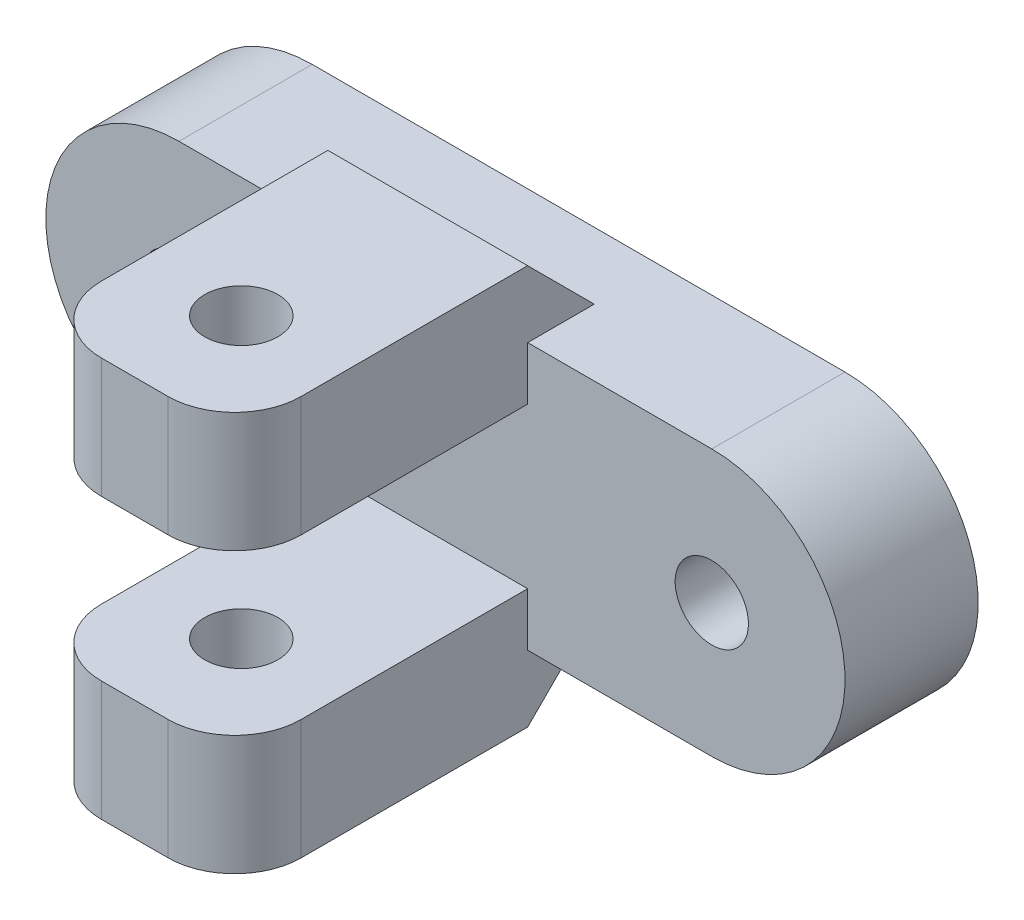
ISO-10303-21;
HEADER;
FILE_DESCRIPTION(('STEP AP214'),'2;1');
FILE_NAME('part.step','',(''),(''),'','','');
FILE_SCHEMA(('AUTOMOTIVE_DESIGN { 1 0 10303 214 1 1 1 1 }'));
ENDSEC;
DATA;
#1=APPLICATION_CONTEXT('core data for automotive mechanical design processes');
#2=APPLICATION_PROTOCOL_DEFINITION('international standard','automotive_design',2000,#1);
#3=PRODUCT_CONTEXT('',#1,'mechanical');
#4=PRODUCT('Part','Part','',(#3));
#5=PRODUCT_RELATED_PRODUCT_CATEGORY('part','',(#4));
#6=PRODUCT_DEFINITION_FORMATION('','',#4);
#7=PRODUCT_DEFINITION_CONTEXT('part definition',#1,'design');
#8=PRODUCT_DEFINITION('design','',#6,#7);
#9=PRODUCT_DEFINITION_SHAPE('','',#8);
#10=(LENGTH_UNIT() NAMED_UNIT(*) SI_UNIT(.MILLI.,.METRE.));
#11=(NAMED_UNIT(*) PLANE_ANGLE_UNIT() SI_UNIT($,.RADIAN.));
#12=(NAMED_UNIT(*) SI_UNIT($,.STERADIAN.) SOLID_ANGLE_UNIT());
#13=UNCERTAINTY_MEASURE_WITH_UNIT(LENGTH_MEASURE(1.E-05),#10,'distance_accuracy_value','');
#14=(GEOMETRIC_REPRESENTATION_CONTEXT(3) GLOBAL_UNCERTAINTY_ASSIGNED_CONTEXT((#13)) GLOBAL_UNIT_ASSIGNED_CONTEXT((#10,
#11,#12)) REPRESENTATION_CONTEXT('',''));
#15=CARTESIAN_POINT('',(0.,0.,0.));
#16=DIRECTION('',(0.,0.,1.));
#17=DIRECTION('',(1.,0.,0.));
#18=AXIS2_PLACEMENT_3D('',#15,#16,#17);
#19=CARTESIAN_POINT('',(-43.018930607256,15.,17.));
#20=DIRECTION('',(0.,-1.,0.));
#21=DIRECTION('',(1.,0.,0.));
#22=AXIS2_PLACEMENT_3D('',#19,#20,#21);
#23=CYLINDRICAL_SURFACE('',#22,5.);
#24=DIRECTION('',(0.,1.,0.));
#25=VECTOR('',#24,1.);
#26=CARTESIAN_POINT('',(-48.018930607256,15.,17.));
#27=LINE('',#26,#25);
#28=CARTESIAN_POINT('',(-48.018930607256,6.,17.));
#29=VERTEX_POINT('',#28);
#30=CARTESIAN_POINT('',(-48.018930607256,15.,17.));
#31=VERTEX_POINT('',#30);
#32=EDGE_CURVE('E330',#29,#31,#27,.T.);
#33=ORIENTED_EDGE('',*,*,#32,.F.);
#34=CARTESIAN_POINT('',(-43.018930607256,6.,17.));
#35=DIRECTION('',(0.,1.,0.));
#36=DIRECTION('',(0.,0.,1.));
#37=AXIS2_PLACEMENT_3D('',#34,#35,#36);
#38=CIRCLE('',#37,5.);
#39=CARTESIAN_POINT('',(-43.018930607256,6.,22.));
#40=VERTEX_POINT('',#39);
#41=EDGE_CURVE('E40',#40,#29,#38,.F.);
#42=ORIENTED_EDGE('',*,*,#41,.F.);
#43=DIRECTION('',(0.,1.,0.));
#44=VECTOR('',#43,1.);
#45=CARTESIAN_POINT('',(-43.018930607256,15.,22.));
#46=LINE('',#45,#44);
#47=CARTESIAN_POINT('',(-43.018930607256,15.,22.));
#48=VERTEX_POINT('',#47);
#49=EDGE_CURVE('E333',#48,#40,#46,.F.);
#50=ORIENTED_EDGE('',*,*,#49,.F.);
#51=CARTESIAN_POINT('',(-43.018930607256,15.,17.));
#52=DIRECTION('',(0.,-1.,0.));
#53=DIRECTION('',(0.,0.,-1.));
#54=AXIS2_PLACEMENT_3D('',#51,#52,#53);
#55=CIRCLE('',#54,5.);
#56=EDGE_CURVE('E11',#31,#48,#55,.F.);
#57=ORIENTED_EDGE('',*,*,#56,.F.);
#58=EDGE_LOOP('',(#33,#42,#50,#57));
#59=FACE_BOUND('',#58,.T.);
#60=ADVANCED_FACE('F33',(#59),#23,.T.);
#61=CARTESIAN_POINT('',(-38.018930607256,15.,17.));
#62=DIRECTION('',(0.,1.,0.));
#63=DIRECTION('',(-1.,0.,0.));
#64=AXIS2_PLACEMENT_3D('',#61,#62,#63);
#65=CYLINDRICAL_SURFACE('',#64,5.);
#66=DIRECTION('',(0.,-1.,0.));
#67=VECTOR('',#66,1.);
#68=CARTESIAN_POINT('',(-33.018930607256,15.,17.));
#69=LINE('',#68,#67);
#70=CARTESIAN_POINT('',(-33.018930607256,15.,17.));
#71=VERTEX_POINT('',#70);
#72=CARTESIAN_POINT('',(-33.018930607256,6.,17.));
#73=VERTEX_POINT('',#72);
#74=EDGE_CURVE('E319',#71,#73,#69,.T.);
#75=ORIENTED_EDGE('',*,*,#74,.F.);
#76=CARTESIAN_POINT('',(-38.018930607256,15.,17.));
#77=DIRECTION('',(0.,-1.,0.));
#78=DIRECTION('',(0.,0.,-1.));
#79=AXIS2_PLACEMENT_3D('',#76,#77,#78);
#80=CIRCLE('',#79,5.);
#81=CARTESIAN_POINT('',(-38.018930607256,15.,22.));
#82=VERTEX_POINT('',#81);
#83=EDGE_CURVE('E325',#82,#71,#80,.F.);
#84=ORIENTED_EDGE('',*,*,#83,.F.);
#85=DIRECTION('',(0.,-1.,0.));
#86=VECTOR('',#85,1.);
#87=CARTESIAN_POINT('',(-38.018930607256,15.,22.));
#88=LINE('',#87,#86);
#89=CARTESIAN_POINT('',(-38.018930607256,6.,22.));
#90=VERTEX_POINT('',#89);
#91=EDGE_CURVE('E322',#90,#82,#88,.F.);
#92=ORIENTED_EDGE('',*,*,#91,.F.);
#93=CARTESIAN_POINT('',(-38.018930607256,6.,17.));
#94=DIRECTION('',(0.,1.,0.));
#95=DIRECTION('',(0.,0.,1.));
#96=AXIS2_PLACEMENT_3D('',#93,#94,#95);
#97=CIRCLE('',#96,5.);
#98=EDGE_CURVE('E327',#73,#90,#97,.F.);
#99=ORIENTED_EDGE('',*,*,#98,.F.);
#100=EDGE_LOOP('',(#75,#84,#92,#99));
#101=FACE_BOUND('',#100,.T.);
#102=ADVANCED_FACE('F399',(#101),#65,.T.);
#103=CARTESIAN_POINT('',(-43.018930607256,15.,17.));
#104=DIRECTION('',(0.,-1.,0.));
#105=DIRECTION('',(1.,0.,0.));
#106=AXIS2_PLACEMENT_3D('',#103,#104,#105);
#107=CYLINDRICAL_SURFACE('',#106,5.);
#108=DIRECTION('',(0.,1.,0.));
#109=VECTOR('',#108,1.);
#110=CARTESIAN_POINT('',(-48.018930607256,15.,17.));
#111=LINE('',#110,#109);
#112=CARTESIAN_POINT('',(-48.018930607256,-15.,17.));
#113=VERTEX_POINT('',#112);
#114=CARTESIAN_POINT('',(-48.018930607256,-6.,17.));
#115=VERTEX_POINT('',#114);
#116=EDGE_CURVE('E176',#113,#115,#111,.T.);
#117=ORIENTED_EDGE('',*,*,#116,.F.);
#118=CARTESIAN_POINT('',(-43.018930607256,-15.,17.));
#119=DIRECTION('',(0.,1.,0.));
#120=DIRECTION('',(0.,0.,1.));
#121=AXIS2_PLACEMENT_3D('',#118,#119,#120);
#122=CIRCLE('',#121,5.);
#123=CARTESIAN_POINT('',(-43.018930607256,-15.,22.));
#124=VERTEX_POINT('',#123);
#125=EDGE_CURVE('E315',#124,#113,#122,.F.);
#126=ORIENTED_EDGE('',*,*,#125,.F.);
#127=DIRECTION('',(0.,1.,0.));
#128=VECTOR('',#127,1.);
#129=CARTESIAN_POINT('',(-43.018930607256,15.,22.));
#130=LINE('',#129,#128);
#131=CARTESIAN_POINT('',(-43.018930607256,-6.,22.));
#132=VERTEX_POINT('',#131);
#133=EDGE_CURVE('E312',#132,#124,#130,.F.);
#134=ORIENTED_EDGE('',*,*,#133,.F.);
#135=CARTESIAN_POINT('',(-43.018930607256,-6.,17.));
#136=DIRECTION('',(0.,-1.,0.));
#137=DIRECTION('',(0.,0.,-1.));
#138=AXIS2_PLACEMENT_3D('',#135,#136,#137);
#139=CIRCLE('',#138,5.);
#140=EDGE_CURVE('E317',#115,#132,#139,.F.);
#141=ORIENTED_EDGE('',*,*,#140,.F.);
#142=EDGE_LOOP('',(#117,#126,#134,#141));
#143=FACE_BOUND('',#142,.T.);
#144=ADVANCED_FACE('F374',(#143),#107,.T.);
#145=CARTESIAN_POINT('',(-38.018930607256,0.,17.));
#146=DIRECTION('',(0.,-1.,0.));
#147=DIRECTION('',(1.,0.,0.));
#148=AXIS2_PLACEMENT_3D('',#145,#146,#147);
#149=CYLINDRICAL_SURFACE('',#148,5.);
#150=DIRECTION('',(0.,1.,0.));
#151=VECTOR('',#150,1.);
#152=CARTESIAN_POINT('',(-38.018930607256,0.,22.));
#153=LINE('',#152,#151);
#154=CARTESIAN_POINT('',(-38.018930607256,-15.,22.));
#155=VERTEX_POINT('',#154);
#156=CARTESIAN_POINT('',(-38.018930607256,-6.,22.));
#157=VERTEX_POINT('',#156);
#158=EDGE_CURVE('E300',#155,#157,#153,.T.);
#159=ORIENTED_EDGE('',*,*,#158,.F.);
#160=CARTESIAN_POINT('',(-38.018930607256,-15.,17.));
#161=DIRECTION('',(0.,1.,0.));
#162=DIRECTION('',(0.,0.,1.));
#163=AXIS2_PLACEMENT_3D('',#160,#161,#162);
#164=CIRCLE('',#163,5.);
#165=CARTESIAN_POINT('',(-33.018930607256,-15.,17.));
#166=VERTEX_POINT('',#165);
#167=EDGE_CURVE('E306',#166,#155,#164,.F.);
#168=ORIENTED_EDGE('',*,*,#167,.F.);
#169=DIRECTION('',(0.,1.,0.));
#170=VECTOR('',#169,1.);
#171=CARTESIAN_POINT('',(-33.018930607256,0.,17.));
#172=LINE('',#171,#170);
#173=CARTESIAN_POINT('',(-33.018930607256,-6.,17.));
#174=VERTEX_POINT('',#173);
#175=EDGE_CURVE('E303',#174,#166,#172,.F.);
#176=ORIENTED_EDGE('',*,*,#175,.F.);
#177=CARTESIAN_POINT('',(-38.018930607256,-6.,17.));
#178=DIRECTION('',(0.,-1.,0.));
#179=DIRECTION('',(0.,0.,-1.));
#180=AXIS2_PLACEMENT_3D('',#177,#178,#179);
#181=CIRCLE('',#180,5.);
#182=EDGE_CURVE('E309',#157,#174,#181,.F.);
#183=ORIENTED_EDGE('',*,*,#182,.F.);
#184=EDGE_LOOP('',(#159,#168,#176,#183));
#185=FACE_BOUND('',#184,.T.);
#186=ADVANCED_FACE('F372',(#185),#149,.T.);
#187=CARTESIAN_POINT('',(-48.018930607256,15.,30.));
#188=DIRECTION('',(1.,0.,0.));
#189=DIRECTION('',(0.,1.,0.));
#190=AXIS2_PLACEMENT_3D('',#187,#188,#189);
#191=PLANE('',#190);
#192=DIRECTION('',(0.,0.,1.));
#193=VECTOR('',#192,1.);
#194=CARTESIAN_POINT('',(-48.018930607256,6.,30.));
#195=LINE('',#194,#193);
#196=CARTESIAN_POINT('',(-48.018930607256,6.,0.));
#197=VERTEX_POINT('',#196);
#198=EDGE_CURVE('E206',#197,#29,#195,.T.);
#199=ORIENTED_EDGE('',*,*,#198,.T.);
#200=ORIENTED_EDGE('',*,*,#32,.T.);
#201=DIRECTION('',(0.,0.,-1.));
#202=VECTOR('',#201,1.);
#203=CARTESIAN_POINT('',(-48.018930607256,15.,30.));
#204=LINE('',#203,#202);
#205=CARTESIAN_POINT('',(-48.018930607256,15.,0.));
#206=VERTEX_POINT('',#205);
#207=EDGE_CURVE('E216',#31,#206,#204,.T.);
#208=ORIENTED_EDGE('',*,*,#207,.T.);
#209=DIRECTION('',(0.,-0.707106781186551,-0.707106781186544));
#210=VECTOR('',#209,1.);
#211=CARTESIAN_POINT('',(-48.018930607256,30.,14.9999999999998));
#212=LINE('',#211,#210);
#213=CARTESIAN_POINT('',(-48.018930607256,10.,-4.99999999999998));
#214=VERTEX_POINT('',#213);
#215=EDGE_CURVE('E295',#206,#214,#212,.T.);
#216=ORIENTED_EDGE('',*,*,#215,.T.);
#217=DIRECTION('',(0.,0.,-1.));
#218=VECTOR('',#217,1.);
#219=CARTESIAN_POINT('',(-48.018930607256,10.,-10.));
#220=LINE('',#219,#218);
#221=CARTESIAN_POINT('',(-48.018930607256,10.,0.));
#222=VERTEX_POINT('',#221);
#223=EDGE_CURVE('E292',#222,#214,#220,.T.);
#224=ORIENTED_EDGE('',*,*,#223,.F.);
#225=DIRECTION('',(0.,-1.,0.));
#226=VECTOR('',#225,1.);
#227=CARTESIAN_POINT('',(-48.018930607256,15.,0.));
#228=LINE('',#227,#226);
#229=EDGE_CURVE('E197',#222,#197,#228,.T.);
#230=ORIENTED_EDGE('',*,*,#229,.T.);
#231=EDGE_LOOP('',(#199,#200,#208,#216,#224,#230));
#232=FACE_BOUND('',#231,.T.);
#233=ADVANCED_FACE('F342',(#232),#191,.F.);
#234=CARTESIAN_POINT('',(-33.018930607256,15.,30.));
#235=DIRECTION('',(-1.,0.,0.));
#236=DIRECTION('',(0.,-1.,0.));
#237=AXIS2_PLACEMENT_3D('',#234,#235,#236);
#238=PLANE('',#237);
#239=DIRECTION('',(0.,0.,-1.));
#240=VECTOR('',#239,1.);
#241=CARTESIAN_POINT('',(-33.018930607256,15.,30.));
#242=LINE('',#241,#240);
#243=CARTESIAN_POINT('',(-33.018930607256,15.,0.));
#244=VERTEX_POINT('',#243);
#245=EDGE_CURVE('E218',#71,#244,#242,.T.);
#246=ORIENTED_EDGE('',*,*,#245,.F.);
#247=ORIENTED_EDGE('',*,*,#74,.T.);
#248=DIRECTION('',(0.,0.,-1.));
#249=VECTOR('',#248,1.);
#250=CARTESIAN_POINT('',(-33.018930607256,6.,30.));
#251=LINE('',#250,#249);
#252=CARTESIAN_POINT('',(-33.018930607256,6.,0.));
#253=VERTEX_POINT('',#252);
#254=EDGE_CURVE('E178',#73,#253,#251,.T.);
#255=ORIENTED_EDGE('',*,*,#254,.T.);
#256=DIRECTION('',(0.,1.,0.));
#257=VECTOR('',#256,1.);
#258=CARTESIAN_POINT('',(-33.018930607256,15.,0.));
#259=LINE('',#258,#257);
#260=CARTESIAN_POINT('',(-33.018930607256,10.,0.));
#261=VERTEX_POINT('',#260);
#262=EDGE_CURVE('E202',#253,#261,#259,.T.);
#263=ORIENTED_EDGE('',*,*,#262,.T.);
#264=DIRECTION('',(0.,0.,1.));
#265=VECTOR('',#264,1.);
#266=CARTESIAN_POINT('',(-33.018930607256,10.,-10.));
#267=LINE('',#266,#265);
#268=CARTESIAN_POINT('',(-33.018930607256,10.,-4.99999999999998));
#269=VERTEX_POINT('',#268);
#270=EDGE_CURVE('E287',#269,#261,#267,.T.);
#271=ORIENTED_EDGE('',*,*,#270,.F.);
#272=DIRECTION('',(0.,0.707106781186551,0.707106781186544));
#273=VECTOR('',#272,1.);
#274=CARTESIAN_POINT('',(-33.018930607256,30.,14.9999999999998));
#275=LINE('',#274,#273);
#276=EDGE_CURVE('E297',#269,#244,#275,.T.);
#277=ORIENTED_EDGE('',*,*,#276,.T.);
#278=EDGE_LOOP('',(#246,#247,#255,#263,#271,#277));
#279=FACE_BOUND('',#278,.T.);
#280=ADVANCED_FACE('F395',(#279),#238,.F.);
#281=DIRECTION('',(0.,0.,-1.));
#282=VECTOR('',#281,1.);
#283=CARTESIAN_POINT('',(-48.018930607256,-15.,30.));
#284=LINE('',#283,#282);
#285=CARTESIAN_POINT('',(-48.018930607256,-15.,0.));
#286=VERTEX_POINT('',#285);
#287=EDGE_CURVE('E222',#113,#286,#284,.T.);
#288=ORIENTED_EDGE('',*,*,#287,.F.);
#289=ORIENTED_EDGE('',*,*,#116,.T.);
#290=DIRECTION('',(0.,0.,-1.));
#291=VECTOR('',#290,1.);
#292=CARTESIAN_POINT('',(-48.018930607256,-6.,30.));
#293=LINE('',#292,#291);
#294=CARTESIAN_POINT('',(-48.018930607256,-6.,0.));
#295=VERTEX_POINT('',#294);
#296=EDGE_CURVE('E168',#115,#295,#293,.T.);
#297=ORIENTED_EDGE('',*,*,#296,.T.);
#298=CARTESIAN_POINT('',(-48.018930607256,-10.,0.));
#299=VERTEX_POINT('',#298);
#300=EDGE_CURVE('E173',#295,#299,#228,.T.);
#301=ORIENTED_EDGE('',*,*,#300,.T.);
#302=DIRECTION('',(0.,0.,1.));
#303=VECTOR('',#302,1.);
#304=CARTESIAN_POINT('',(-48.018930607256,-10.,-10.));
#305=LINE('',#304,#303);
#306=CARTESIAN_POINT('',(-48.018930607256,-10.,-4.99999999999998));
#307=VERTEX_POINT('',#306);
#308=EDGE_CURVE('E274',#307,#299,#305,.T.);
#309=ORIENTED_EDGE('',*,*,#308,.F.);
#310=DIRECTION('',(0.,-0.707106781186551,0.707106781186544));
#311=VECTOR('',#310,1.);
#312=CARTESIAN_POINT('',(-48.018930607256,-14.9999999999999,-1.59594559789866E-13));
#313=LINE('',#312,#311);
#314=EDGE_CURVE('E284',#307,#286,#313,.T.);
#315=ORIENTED_EDGE('',*,*,#314,.T.);
#316=EDGE_LOOP('',(#288,#289,#297,#301,#309,#315));
#317=FACE_BOUND('',#316,.T.);
#318=ADVANCED_FACE('F171',(#317),#191,.F.);
#319=CARTESIAN_POINT('',(-48.018930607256,-15.,30.));
#320=DIRECTION('',(0.,1.,0.));
#321=DIRECTION('',(0.,0.,1.));
#322=AXIS2_PLACEMENT_3D('',#319,#320,#321);
#323=PLANE('',#322);
#324=CARTESIAN_POINT('',(-40.518930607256,-15.,14.));
#325=DIRECTION('',(0.,-1.,0.));
#326=DIRECTION('',(0.,0.,-1.));
#327=AXIS2_PLACEMENT_3D('',#324,#325,#326);
#328=CIRCLE('',#327,2.75);
#329=CARTESIAN_POINT('',(-40.518930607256,-15.,11.25));
#330=VERTEX_POINT('',#329);
#331=EDGE_CURVE('E351',#330,#330,#328,.T.);
#332=ORIENTED_EDGE('',*,*,#331,.F.);
#333=EDGE_LOOP('',(#332));
#334=FACE_BOUND('',#333,.T.);
#335=DIRECTION('',(1.,0.,0.));
#336=VECTOR('',#335,1.);
#337=CARTESIAN_POINT('',(-48.018930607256,-15.,22.));
#338=LINE('',#337,#336);
#339=EDGE_CURVE('E360',#124,#155,#338,.T.);
#340=ORIENTED_EDGE('',*,*,#339,.F.);
#341=ORIENTED_EDGE('',*,*,#125,.T.);
#342=ORIENTED_EDGE('',*,*,#287,.T.);
#343=DIRECTION('',(1.,0.,0.));
#344=VECTOR('',#343,1.);
#345=CARTESIAN_POINT('',(-48.018930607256,-15.,0.));
#346=LINE('',#345,#344);
#347=CARTESIAN_POINT('',(-33.018930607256,-15.,0.));
#348=VERTEX_POINT('',#347);
#349=EDGE_CURVE('E208',#286,#348,#346,.T.);
#350=ORIENTED_EDGE('',*,*,#349,.T.);
#351=DIRECTION('',(0.,0.,-1.));
#352=VECTOR('',#351,1.);
#353=CARTESIAN_POINT('',(-33.018930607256,-15.,30.));
#354=LINE('',#353,#352);
#355=EDGE_CURVE('E220',#166,#348,#354,.T.);
#356=ORIENTED_EDGE('',*,*,#355,.F.);
#357=ORIENTED_EDGE('',*,*,#167,.T.);
#358=EDGE_LOOP('',(#340,#341,#342,#350,#356,#357));
#359=FACE_BOUND('',#358,.T.);
#360=ADVANCED_FACE('F369',(#334,#359),#323,.F.);
#361=DIRECTION('',(0.,0.,1.));
#362=VECTOR('',#361,1.);
#363=CARTESIAN_POINT('',(-33.018930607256,-6.,30.));
#364=LINE('',#363,#362);
#365=CARTESIAN_POINT('',(-33.018930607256,-6.,0.));
#366=VERTEX_POINT('',#365);
#367=EDGE_CURVE('E179',#366,#174,#364,.T.);
#368=ORIENTED_EDGE('',*,*,#367,.T.);
#369=ORIENTED_EDGE('',*,*,#175,.T.);
#370=ORIENTED_EDGE('',*,*,#355,.T.);
#371=DIRECTION('',(0.,0.707106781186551,-0.707106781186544));
#372=VECTOR('',#371,1.);
#373=CARTESIAN_POINT('',(-33.018930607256,-14.9999999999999,-1.59594559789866E-13));
#374=LINE('',#373,#372);
#375=CARTESIAN_POINT('',(-33.018930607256,-10.,-4.99999999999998));
#376=VERTEX_POINT('',#375);
#377=EDGE_CURVE('E282',#348,#376,#374,.T.);
#378=ORIENTED_EDGE('',*,*,#377,.T.);
#379=DIRECTION('',(0.,0.,-1.));
#380=VECTOR('',#379,1.);
#381=CARTESIAN_POINT('',(-33.018930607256,-10.,-10.));
#382=LINE('',#381,#380);
#383=CARTESIAN_POINT('',(-33.018930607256,-10.,0.));
#384=VERTEX_POINT('',#383);
#385=EDGE_CURVE('E279',#384,#376,#382,.T.);
#386=ORIENTED_EDGE('',*,*,#385,.F.);
#387=EDGE_CURVE('E198',#384,#366,#259,.T.);
#388=ORIENTED_EDGE('',*,*,#387,.T.);
#389=EDGE_LOOP('',(#368,#369,#370,#378,#386,#388));
#390=FACE_BOUND('',#389,.T.);
#391=ADVANCED_FACE('F382',(#390),#238,.F.);
#392=CARTESIAN_POINT('',(-48.018930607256,15.,30.));
#393=DIRECTION('',(0.,-1.,0.));
#394=DIRECTION('',(0.,0.,-1.));
#395=AXIS2_PLACEMENT_3D('',#392,#393,#394);
#396=PLANE('',#395);
#397=CARTESIAN_POINT('',(-40.518930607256,15.,14.));
#398=DIRECTION('',(0.,-1.,0.));
#399=DIRECTION('',(0.,0.,-1.));
#400=AXIS2_PLACEMENT_3D('',#397,#398,#399);
#401=CIRCLE('',#400,2.75);
#402=CARTESIAN_POINT('',(-40.518930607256,15.,11.25));
#403=VERTEX_POINT('',#402);
#404=EDGE_CURVE('E271',#403,#403,#401,.T.);
#405=ORIENTED_EDGE('',*,*,#404,.T.);
#406=EDGE_LOOP('',(#405));
#407=FACE_BOUND('',#406,.T.);
#408=ORIENTED_EDGE('',*,*,#207,.F.);
#409=ORIENTED_EDGE('',*,*,#56,.T.);
#410=DIRECTION('',(-1.,0.,0.));
#411=VECTOR('',#410,1.);
#412=CARTESIAN_POINT('',(-48.018930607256,15.,22.));
#413=LINE('',#412,#411);
#414=EDGE_CURVE('E354',#82,#48,#413,.T.);
#415=ORIENTED_EDGE('',*,*,#414,.F.);
#416=ORIENTED_EDGE('',*,*,#83,.T.);
#417=ORIENTED_EDGE('',*,*,#245,.T.);
#418=DIRECTION('',(-1.,0.,0.));
#419=VECTOR('',#418,1.);
#420=CARTESIAN_POINT('',(-48.018930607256,15.,0.));
#421=LINE('',#420,#419);
#422=EDGE_CURVE('E210',#244,#206,#421,.T.);
#423=ORIENTED_EDGE('',*,*,#422,.T.);
#424=EDGE_LOOP('',(#408,#409,#415,#416,#417,#423));
#425=FACE_BOUND('',#424,.T.);
#426=ADVANCED_FACE('F402',(#407,#425),#396,.F.);
#427=CARTESIAN_POINT('',(-49.2844659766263,6.,0.));
#428=DIRECTION('',(0.,1.,0.));
#429=DIRECTION('',(0.,0.,1.));
#430=AXIS2_PLACEMENT_3D('',#427,#428,#429);
#431=PLANE('',#430);
#432=CARTESIAN_POINT('',(-40.518930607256,6.,14.));
#433=DIRECTION('',(0.,1.,0.));
#434=DIRECTION('',(0.,0.,1.));
#435=AXIS2_PLACEMENT_3D('',#432,#433,#434);
#436=CIRCLE('',#435,2.75);
#437=CARTESIAN_POINT('',(-40.518930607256,6.,16.75));
#438=VERTEX_POINT('',#437);
#439=EDGE_CURVE('E189',#438,#438,#436,.T.);
#440=ORIENTED_EDGE('',*,*,#439,.T.);
#441=EDGE_LOOP('',(#440));
#442=FACE_BOUND('',#441,.T.);
#443=DIRECTION('',(1.,0.,0.));
#444=VECTOR('',#443,1.);
#445=CARTESIAN_POINT('',(-49.2844659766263,6.,22.));
#446=LINE('',#445,#444);
#447=EDGE_CURVE('E340',#40,#90,#446,.T.);
#448=ORIENTED_EDGE('',*,*,#447,.F.);
#449=ORIENTED_EDGE('',*,*,#41,.T.);
#450=ORIENTED_EDGE('',*,*,#198,.F.);
#451=DIRECTION('',(-1.,0.,0.));
#452=VECTOR('',#451,1.);
#453=CARTESIAN_POINT('',(-49.2844659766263,6.,0.));
#454=LINE('',#453,#452);
#455=EDGE_CURVE('E188',#253,#197,#454,.T.);
#456=ORIENTED_EDGE('',*,*,#455,.F.);
#457=ORIENTED_EDGE('',*,*,#254,.F.);
#458=ORIENTED_EDGE('',*,*,#98,.T.);
#459=EDGE_LOOP('',(#448,#449,#450,#456,#457,#458));
#460=FACE_BOUND('',#459,.T.);
#461=ADVANCED_FACE('F336',(#442,#460),#431,.F.);
#462=CARTESIAN_POINT('',(-49.2844659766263,-6.,0.));
#463=DIRECTION('',(0.,-1.,0.));
#464=DIRECTION('',(0.,0.,-1.));
#465=AXIS2_PLACEMENT_3D('',#462,#463,#464);
#466=PLANE('',#465);
#467=CARTESIAN_POINT('',(-40.518930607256,-6.,14.));
#468=DIRECTION('',(0.,-1.,0.));
#469=DIRECTION('',(0.,0.,-1.));
#470=AXIS2_PLACEMENT_3D('',#467,#468,#469);
#471=CIRCLE('',#470,2.75);
#472=CARTESIAN_POINT('',(-40.518930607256,-6.,11.25));
#473=VERTEX_POINT('',#472);
#474=EDGE_CURVE('E268',#473,#473,#471,.T.);
#475=ORIENTED_EDGE('',*,*,#474,.T.);
#476=EDGE_LOOP('',(#475));
#477=FACE_BOUND('',#476,.T.);
#478=ORIENTED_EDGE('',*,*,#296,.F.);
#479=ORIENTED_EDGE('',*,*,#140,.T.);
#480=DIRECTION('',(-1.,0.,0.));
#481=VECTOR('',#480,1.);
#482=CARTESIAN_POINT('',(-49.2844659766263,-6.,22.));
#483=LINE('',#482,#481);
#484=EDGE_CURVE('E201',#157,#132,#483,.T.);
#485=ORIENTED_EDGE('',*,*,#484,.F.);
#486=ORIENTED_EDGE('',*,*,#182,.T.);
#487=ORIENTED_EDGE('',*,*,#367,.F.);
#488=DIRECTION('',(1.,0.,0.));
#489=VECTOR('',#488,1.);
#490=CARTESIAN_POINT('',(-49.2844659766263,-6.,0.));
#491=LINE('',#490,#489);
#492=EDGE_CURVE('E182',#295,#366,#491,.T.);
#493=ORIENTED_EDGE('',*,*,#492,.F.);
#494=EDGE_LOOP('',(#478,#479,#485,#486,#487,#493));
#495=FACE_BOUND('',#494,.T.);
#496=ADVANCED_FACE('F183',(#477,#495),#466,.F.);
#497=CARTESIAN_POINT('',(-59.1949113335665,0.,-10.));
#498=DIRECTION('',(0.,0.,1.));
#499=DIRECTION('',(1.,0.,0.));
#500=AXIS2_PLACEMENT_3D('',#497,#498,#499);
#501=CYLINDRICAL_SURFACE('',#500,10.);
#502=CARTESIAN_POINT('',(-59.1949113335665,0.,0.));
#503=DIRECTION('',(0.,0.,1.));
#504=DIRECTION('',(1.,0.,0.));
#505=AXIS2_PLACEMENT_3D('',#502,#503,#504);
#506=CIRCLE('',#505,10.);
#507=CARTESIAN_POINT('',(-59.1949113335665,10.,0.));
#508=VERTEX_POINT('',#507);
#509=CARTESIAN_POINT('',(-59.1949113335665,-10.,0.));
#510=VERTEX_POINT('',#509);
#511=EDGE_CURVE('E234',#508,#510,#506,.T.);
#512=ORIENTED_EDGE('',*,*,#511,.F.);
#513=DIRECTION('',(0.,0.,1.));
#514=VECTOR('',#513,1.);
#515=CARTESIAN_POINT('',(-59.1949113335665,10.,-10.));
#516=LINE('',#515,#514);
#517=CARTESIAN_POINT('',(-59.1949113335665,10.,-10.));
#518=VERTEX_POINT('',#517);
#519=EDGE_CURVE('E213',#518,#508,#516,.T.);
#520=ORIENTED_EDGE('',*,*,#519,.F.);
#521=CARTESIAN_POINT('',(-59.1949113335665,0.,-10.));
#522=DIRECTION('',(0.,0.,1.));
#523=DIRECTION('',(1.,0.,0.));
#524=AXIS2_PLACEMENT_3D('',#521,#522,#523);
#525=CIRCLE('',#524,10.);
#526=CARTESIAN_POINT('',(-59.1949113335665,-10.,-10.));
#527=VERTEX_POINT('',#526);
#528=EDGE_CURVE('E237',#518,#527,#525,.T.);
#529=ORIENTED_EDGE('',*,*,#528,.T.);
#530=DIRECTION('',(0.,0.,1.));
#531=VECTOR('',#530,1.);
#532=CARTESIAN_POINT('',(-59.1949113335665,-10.,-10.));
#533=LINE('',#532,#531);
#534=EDGE_CURVE('E250',#527,#510,#533,.T.);
#535=ORIENTED_EDGE('',*,*,#534,.T.);
#536=EDGE_LOOP('',(#512,#520,#529,#535));
#537=FACE_BOUND('',#536,.T.);
#538=ADVANCED_FACE('F409',(#537),#501,.T.);
#539=CARTESIAN_POINT('',(-59.1949113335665,10.,-10.));
#540=DIRECTION('',(0.,1.,0.));
#541=DIRECTION('',(0.,0.,1.));
#542=AXIS2_PLACEMENT_3D('',#539,#540,#541);
#543=PLANE('',#542);
#544=DIRECTION('',(-1.,0.,0.));
#545=VECTOR('',#544,1.);
#546=CARTESIAN_POINT('',(-59.1949113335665,10.,0.));
#547=LINE('',#546,#545);
#548=EDGE_CURVE('E257',#222,#508,#547,.T.);
#549=ORIENTED_EDGE('',*,*,#548,.F.);
#550=ORIENTED_EDGE('',*,*,#223,.T.);
#551=DIRECTION('',(1.,0.,0.));
#552=VECTOR('',#551,1.);
#553=CARTESIAN_POINT('',(-59.1949113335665,10.,-4.99999999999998));
#554=LINE('',#553,#552);
#555=EDGE_CURVE('E289',#214,#269,#554,.T.);
#556=ORIENTED_EDGE('',*,*,#555,.T.);
#557=ORIENTED_EDGE('',*,*,#270,.T.);
#558=CARTESIAN_POINT('',(-19.1949113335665,10.,0.));
#559=VERTEX_POINT('',#558);
#560=EDGE_CURVE('E241',#559,#261,#547,.T.);
#561=ORIENTED_EDGE('',*,*,#560,.F.);
#562=DIRECTION('',(0.,0.,1.));
#563=VECTOR('',#562,1.);
#564=CARTESIAN_POINT('',(-19.1949113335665,10.,-10.));
#565=LINE('',#564,#563);
#566=CARTESIAN_POINT('',(-19.1949113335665,10.,-10.));
#567=VERTEX_POINT('',#566);
#568=EDGE_CURVE('E262',#567,#559,#565,.T.);
#569=ORIENTED_EDGE('',*,*,#568,.F.);
#570=DIRECTION('',(-1.,0.,0.));
#571=VECTOR('',#570,1.);
#572=CARTESIAN_POINT('',(-59.1949113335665,10.,-10.));
#573=LINE('',#572,#571);
#574=EDGE_CURVE('E247',#567,#518,#573,.T.);
#575=ORIENTED_EDGE('',*,*,#574,.T.);
#576=ORIENTED_EDGE('',*,*,#519,.T.);
#577=EDGE_LOOP('',(#549,#550,#556,#557,#561,#569,#575,#576));
#578=FACE_BOUND('',#577,.T.);
#579=ADVANCED_FACE('F391',(#578),#543,.T.);
#580=CARTESIAN_POINT('',(-19.1949113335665,0.,-10.));
#581=DIRECTION('',(0.,0.,1.));
#582=DIRECTION('',(1.,0.,0.));
#583=AXIS2_PLACEMENT_3D('',#580,#581,#582);
#584=CYLINDRICAL_SURFACE('',#583,10.);
#585=CARTESIAN_POINT('',(-19.1949113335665,0.,0.));
#586=DIRECTION('',(0.,0.,1.));
#587=DIRECTION('',(1.,0.,0.));
#588=AXIS2_PLACEMENT_3D('',#585,#586,#587);
#589=CIRCLE('',#588,10.);
#590=CARTESIAN_POINT('',(-19.1949113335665,-10.,0.));
#591=VERTEX_POINT('',#590);
#592=EDGE_CURVE('E254',#591,#559,#589,.T.);
#593=ORIENTED_EDGE('',*,*,#592,.F.);
#594=DIRECTION('',(0.,0.,1.));
#595=VECTOR('',#594,1.);
#596=CARTESIAN_POINT('',(-19.1949113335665,-10.,-10.));
#597=LINE('',#596,#595);
#598=CARTESIAN_POINT('',(-19.1949113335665,-10.,-10.));
#599=VERTEX_POINT('',#598);
#600=EDGE_CURVE('E264',#599,#591,#597,.T.);
#601=ORIENTED_EDGE('',*,*,#600,.F.);
#602=CARTESIAN_POINT('',(-19.1949113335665,0.,-10.));
#603=DIRECTION('',(0.,0.,1.));
#604=DIRECTION('',(1.,0.,0.));
#605=AXIS2_PLACEMENT_3D('',#602,#603,#604);
#606=CIRCLE('',#605,10.);
#607=EDGE_CURVE('E244',#599,#567,#606,.T.);
#608=ORIENTED_EDGE('',*,*,#607,.T.);
#609=ORIENTED_EDGE('',*,*,#568,.T.);
#610=EDGE_LOOP('',(#593,#601,#608,#609));
#611=FACE_BOUND('',#610,.T.);
#612=ADVANCED_FACE('F416',(#611),#584,.T.);
#613=CARTESIAN_POINT('',(-59.1949113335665,-10.,-10.));
#614=DIRECTION('',(0.,-1.,0.));
#615=DIRECTION('',(0.,0.,-1.));
#616=AXIS2_PLACEMENT_3D('',#613,#614,#615);
#617=PLANE('',#616);
#618=DIRECTION('',(1.,0.,0.));
#619=VECTOR('',#618,1.);
#620=CARTESIAN_POINT('',(-59.1949113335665,-10.,0.));
#621=LINE('',#620,#619);
#622=EDGE_CURVE('E252',#384,#591,#621,.T.);
#623=ORIENTED_EDGE('',*,*,#622,.F.);
#624=ORIENTED_EDGE('',*,*,#385,.T.);
#625=DIRECTION('',(-1.,0.,0.));
#626=VECTOR('',#625,1.);
#627=CARTESIAN_POINT('',(-59.1949113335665,-10.,-4.99999999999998));
#628=LINE('',#627,#626);
#629=EDGE_CURVE('E276',#376,#307,#628,.T.);
#630=ORIENTED_EDGE('',*,*,#629,.T.);
#631=ORIENTED_EDGE('',*,*,#308,.T.);
#632=EDGE_CURVE('E196',#510,#299,#621,.T.);
#633=ORIENTED_EDGE('',*,*,#632,.F.);
#634=ORIENTED_EDGE('',*,*,#534,.F.);
#635=DIRECTION('',(1.,0.,0.));
#636=VECTOR('',#635,1.);
#637=CARTESIAN_POINT('',(-59.1949113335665,-10.,-10.));
#638=LINE('',#637,#636);
#639=EDGE_CURVE('E240',#527,#599,#638,.T.);
#640=ORIENTED_EDGE('',*,*,#639,.T.);
#641=ORIENTED_EDGE('',*,*,#600,.T.);
#642=EDGE_LOOP('',(#623,#624,#630,#631,#633,#634,#640,#641));
#643=FACE_BOUND('',#642,.T.);
#644=ADVANCED_FACE('F385',(#643),#617,.T.);
#645=CARTESIAN_POINT('',(-59.1949113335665,0.,-10.));
#646=DIRECTION('',(0.,0.,1.));
#647=DIRECTION('',(1.,0.,0.));
#648=AXIS2_PLACEMENT_3D('',#645,#646,#647);
#649=PLANE('',#648);
#650=CARTESIAN_POINT('',(-59.1949113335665,0.,-10.));
#651=DIRECTION('',(0.,0.,1.));
#652=DIRECTION('',(1.,0.,0.));
#653=AXIS2_PLACEMENT_3D('',#650,#651,#652);
#654=CIRCLE('',#653,2.75);
#655=CARTESIAN_POINT('',(-56.4449113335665,0.,-10.));
#656=VERTEX_POINT('',#655);
#657=EDGE_CURVE('E225',#656,#656,#654,.T.);
#658=ORIENTED_EDGE('',*,*,#657,.T.);
#659=EDGE_LOOP('',(#658));
#660=FACE_BOUND('',#659,.T.);
#661=CARTESIAN_POINT('',(-19.1949113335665,0.,-10.));
#662=DIRECTION('',(0.,0.,1.));
#663=DIRECTION('',(1.,0.,0.));
#664=AXIS2_PLACEMENT_3D('',#661,#662,#663);
#665=CIRCLE('',#664,2.75);
#666=CARTESIAN_POINT('',(-16.4449113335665,0.,-10.));
#667=VERTEX_POINT('',#666);
#668=EDGE_CURVE('E231',#667,#667,#665,.T.);
#669=ORIENTED_EDGE('',*,*,#668,.T.);
#670=EDGE_LOOP('',(#669));
#671=FACE_BOUND('',#670,.T.);
#672=ORIENTED_EDGE('',*,*,#528,.F.);
#673=ORIENTED_EDGE('',*,*,#574,.F.);
#674=ORIENTED_EDGE('',*,*,#607,.F.);
#675=ORIENTED_EDGE('',*,*,#639,.F.);
#676=EDGE_LOOP('',(#672,#673,#674,#675));
#677=FACE_BOUND('',#676,.T.);
#678=ADVANCED_FACE('F414',(#660,#671,#677),#649,.F.);
#679=CARTESIAN_POINT('',(-59.1949113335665,0.,0.));
#680=DIRECTION('',(0.,0.,1.));
#681=DIRECTION('',(1.,0.,0.));
#682=AXIS2_PLACEMENT_3D('',#679,#680,#681);
#683=PLANE('',#682);
#684=ORIENTED_EDGE('',*,*,#262,.F.);
#685=ORIENTED_EDGE('',*,*,#455,.T.);
#686=ORIENTED_EDGE('',*,*,#229,.F.);
#687=ORIENTED_EDGE('',*,*,#548,.T.);
#688=ORIENTED_EDGE('',*,*,#511,.T.);
#689=ORIENTED_EDGE('',*,*,#632,.T.);
#690=ORIENTED_EDGE('',*,*,#300,.F.);
#691=ORIENTED_EDGE('',*,*,#492,.T.);
#692=ORIENTED_EDGE('',*,*,#387,.F.);
#693=ORIENTED_EDGE('',*,*,#622,.T.);
#694=ORIENTED_EDGE('',*,*,#592,.T.);
#695=ORIENTED_EDGE('',*,*,#560,.T.);
#696=EDGE_LOOP('',(#684,#685,#686,#687,#688,#689,#690,#691,#692,#693,#694,#695));
#697=FACE_BOUND('',#696,.T.);
#698=CARTESIAN_POINT('',(-19.1949113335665,0.,0.));
#699=DIRECTION('',(0.,0.,1.));
#700=DIRECTION('',(1.,0.,0.));
#701=AXIS2_PLACEMENT_3D('',#698,#699,#700);
#702=CIRCLE('',#701,2.75);
#703=CARTESIAN_POINT('',(-16.4449113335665,0.,0.));
#704=VERTEX_POINT('',#703);
#705=EDGE_CURVE('E228',#704,#704,#702,.T.);
#706=ORIENTED_EDGE('',*,*,#705,.F.);
#707=EDGE_LOOP('',(#706));
#708=FACE_BOUND('',#707,.T.);
#709=CARTESIAN_POINT('',(-59.1949113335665,0.,0.));
#710=DIRECTION('',(0.,0.,1.));
#711=DIRECTION('',(1.,0.,0.));
#712=AXIS2_PLACEMENT_3D('',#709,#710,#711);
#713=CIRCLE('',#712,2.75);
#714=CARTESIAN_POINT('',(-56.4449113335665,0.,0.));
#715=VERTEX_POINT('',#714);
#716=EDGE_CURVE('E224',#715,#715,#713,.T.);
#717=ORIENTED_EDGE('',*,*,#716,.F.);
#718=EDGE_LOOP('',(#717));
#719=FACE_BOUND('',#718,.T.);
#720=ADVANCED_FACE('F192',(#697,#708,#719),#683,.T.);
#721=CARTESIAN_POINT('',(-19.1949113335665,0.,-10.));
#722=DIRECTION('',(0.,0.,1.));
#723=DIRECTION('',(1.,0.,0.));
#724=AXIS2_PLACEMENT_3D('',#721,#722,#723);
#725=CYLINDRICAL_SURFACE('',#724,2.75);
#726=ORIENTED_EDGE('',*,*,#668,.F.);
#727=EDGE_LOOP('',(#726));
#728=FACE_BOUND('',#727,.T.);
#729=ORIENTED_EDGE('',*,*,#705,.T.);
#730=EDGE_LOOP('',(#729));
#731=FACE_BOUND('',#730,.T.);
#732=ADVANCED_FACE('F467',(#728,#731),#725,.F.);
#733=CARTESIAN_POINT('',(-59.1949113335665,0.,-10.));
#734=DIRECTION('',(0.,0.,1.));
#735=DIRECTION('',(1.,0.,0.));
#736=AXIS2_PLACEMENT_3D('',#733,#734,#735);
#737=CYLINDRICAL_SURFACE('',#736,2.75);
#738=ORIENTED_EDGE('',*,*,#657,.F.);
#739=EDGE_LOOP('',(#738));
#740=FACE_BOUND('',#739,.T.);
#741=ORIENTED_EDGE('',*,*,#716,.T.);
#742=EDGE_LOOP('',(#741));
#743=FACE_BOUND('',#742,.T.);
#744=ADVANCED_FACE('F463',(#740,#743),#737,.F.);
#745=CARTESIAN_POINT('',(-40.518930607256,15.,14.));
#746=DIRECTION('',(0.,-1.,0.));
#747=DIRECTION('',(0.,0.,-1.));
#748=AXIS2_PLACEMENT_3D('',#745,#746,#747);
#749=CYLINDRICAL_SURFACE('',#748,2.75);
#750=ORIENTED_EDGE('',*,*,#331,.T.);
#751=EDGE_LOOP('',(#750));
#752=FACE_BOUND('',#751,.T.);
#753=ORIENTED_EDGE('',*,*,#474,.F.);
#754=EDGE_LOOP('',(#753));
#755=FACE_BOUND('',#754,.T.);
#756=ADVANCED_FACE('F466',(#752,#755),#749,.F.);
#757=ORIENTED_EDGE('',*,*,#404,.F.);
#758=EDGE_LOOP('',(#757));
#759=FACE_BOUND('',#758,.T.);
#760=ORIENTED_EDGE('',*,*,#439,.F.);
#761=EDGE_LOOP('',(#760));
#762=FACE_BOUND('',#761,.T.);
#763=ADVANCED_FACE('F494',(#759,#762),#749,.F.);
#764=CARTESIAN_POINT('',(0.,0.,22.));
#765=DIRECTION('',(0.,0.,1.));
#766=DIRECTION('',(1.,0.,0.));
#767=AXIS2_PLACEMENT_3D('',#764,#765,#766);
#768=PLANE('',#767);
#769=ORIENTED_EDGE('',*,*,#484,.T.);
#770=ORIENTED_EDGE('',*,*,#133,.T.);
#771=ORIENTED_EDGE('',*,*,#339,.T.);
#772=ORIENTED_EDGE('',*,*,#158,.T.);
#773=EDGE_LOOP('',(#769,#770,#771,#772));
#774=FACE_BOUND('',#773,.T.);
#775=ADVANCED_FACE('F363',(#774),#768,.T.);
#776=ORIENTED_EDGE('',*,*,#414,.T.);
#777=ORIENTED_EDGE('',*,*,#49,.T.);
#778=ORIENTED_EDGE('',*,*,#447,.T.);
#779=ORIENTED_EDGE('',*,*,#91,.T.);
#780=EDGE_LOOP('',(#776,#777,#778,#779));
#781=FACE_BOUND('',#780,.T.);
#782=ADVANCED_FACE('F401',(#781),#768,.T.);
#783=CARTESIAN_POINT('',(0.,-15.,0.));
#784=DIRECTION('',(0.,0.707106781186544,0.707106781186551));
#785=DIRECTION('',(1.,0.,0.));
#786=AXIS2_PLACEMENT_3D('',#783,#784,#785);
#787=PLANE('',#786);
#788=ORIENTED_EDGE('',*,*,#314,.F.);
#789=ORIENTED_EDGE('',*,*,#629,.F.);
#790=ORIENTED_EDGE('',*,*,#377,.F.);
#791=ORIENTED_EDGE('',*,*,#349,.F.);
#792=EDGE_LOOP('',(#788,#789,#790,#791));
#793=FACE_BOUND('',#792,.T.);
#794=ADVANCED_FACE('F380',(#793),#787,.F.);
#795=CARTESIAN_POINT('',(0.,15.,0.));
#796=DIRECTION('',(0.,-0.707106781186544,0.707106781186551));
#797=DIRECTION('',(-1.,0.,0.));
#798=AXIS2_PLACEMENT_3D('',#795,#796,#797);
#799=PLANE('',#798);
#800=ORIENTED_EDGE('',*,*,#276,.F.);
#801=ORIENTED_EDGE('',*,*,#555,.F.);
#802=ORIENTED_EDGE('',*,*,#215,.F.);
#803=ORIENTED_EDGE('',*,*,#422,.F.);
#804=EDGE_LOOP('',(#800,#801,#802,#803));
#805=FACE_BOUND('',#804,.T.);
#806=ADVANCED_FACE('F406',(#805),#799,.F.);
#807=CLOSED_SHELL('',(#60,#102,#144,#186,#233,#280,#318,#360,#391,#426,#461,#496,#538,#579,#612,
#644,#678,#720,#732,#744,#756,#763,#775,#782,#794,#806));
#808=MANIFOLD_SOLID_BREP('B2',#807);
#809=ADVANCED_BREP_SHAPE_REPRESENTATION('',(#18,#808),#14);
#810=SHAPE_DEFINITION_REPRESENTATION(#9,#809);
ENDSEC;
END-ISO-10303-21;
